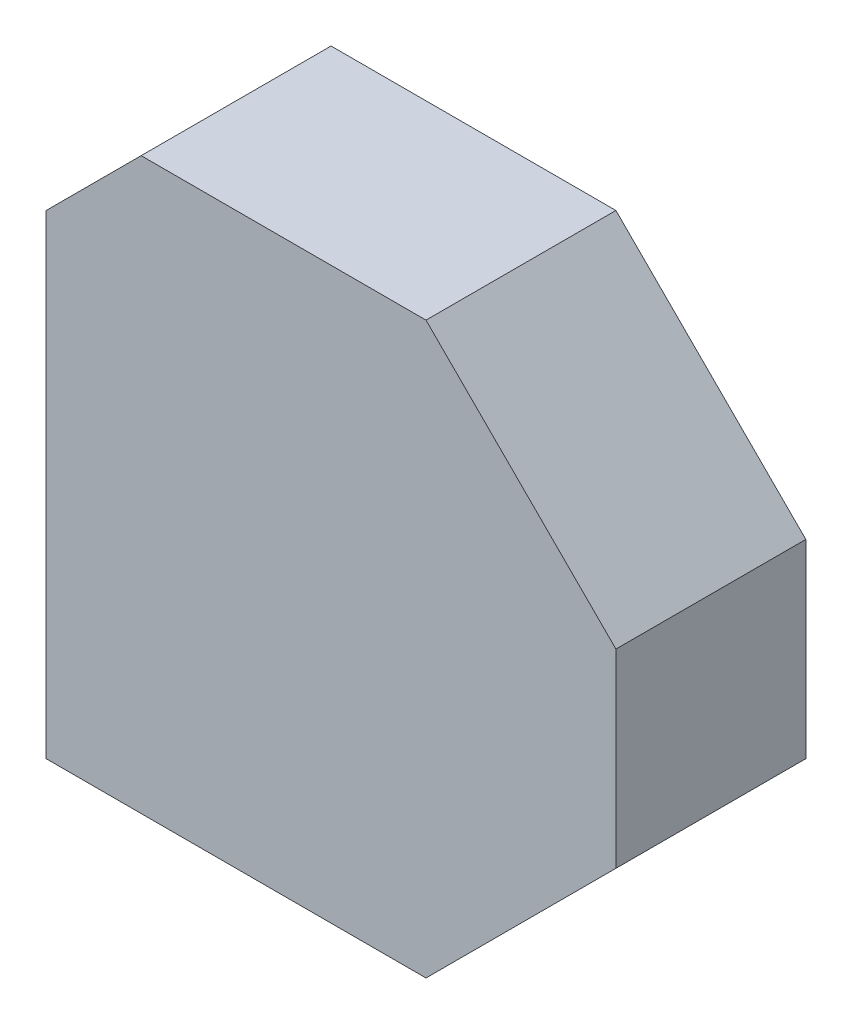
ISO-10303-21;
HEADER;
FILE_DESCRIPTION(('STEP AP214'),'2;1');
FILE_NAME('part.step','',(''),(''),'','','');
FILE_SCHEMA(('AUTOMOTIVE_DESIGN { 1 0 10303 214 1 1 1 1 }'));
ENDSEC;
DATA;
#1=APPLICATION_CONTEXT('core data for automotive mechanical design processes');
#2=APPLICATION_PROTOCOL_DEFINITION('international standard','automotive_design',2000,#1);
#3=PRODUCT_CONTEXT('',#1,'mechanical');
#4=PRODUCT('Part','Part','',(#3));
#5=PRODUCT_RELATED_PRODUCT_CATEGORY('part','',(#4));
#6=PRODUCT_DEFINITION_FORMATION('','',#4);
#7=PRODUCT_DEFINITION_CONTEXT('part definition',#1,'design');
#8=PRODUCT_DEFINITION('design','',#6,#7);
#9=PRODUCT_DEFINITION_SHAPE('','',#8);
#10=(LENGTH_UNIT() NAMED_UNIT(*) SI_UNIT(.MILLI.,.METRE.));
#11=(NAMED_UNIT(*) PLANE_ANGLE_UNIT() SI_UNIT($,.RADIAN.));
#12=(NAMED_UNIT(*) SI_UNIT($,.STERADIAN.) SOLID_ANGLE_UNIT());
#13=UNCERTAINTY_MEASURE_WITH_UNIT(LENGTH_MEASURE(1.E-05),#10,'distance_accuracy_value','');
#14=(GEOMETRIC_REPRESENTATION_CONTEXT(3) GLOBAL_UNCERTAINTY_ASSIGNED_CONTEXT((#13)) GLOBAL_UNIT_ASSIGNED_CONTEXT((#10,
#11,#12)) REPRESENTATION_CONTEXT('',''));
#15=CARTESIAN_POINT('',(0.,0.,0.));
#16=DIRECTION('',(0.,0.,1.));
#17=DIRECTION('',(1.,0.,0.));
#18=AXIS2_PLACEMENT_3D('',#15,#16,#17);
#19=CARTESIAN_POINT('',(0.,0.,10.));
#20=DIRECTION('',(1.,0.,0.));
#21=DIRECTION('',(0.,0.,-1.));
#22=AXIS2_PLACEMENT_3D('',#19,#20,#21);
#23=PLANE('',#22);
#24=DIRECTION('',(0.,-1.,0.));
#25=VECTOR('',#24,1.);
#26=CARTESIAN_POINT('',(0.,0.,10.));
#27=LINE('',#26,#25);
#28=CARTESIAN_POINT('',(0.,25.,10.));
#29=VERTEX_POINT('',#28);
#30=CARTESIAN_POINT('',(0.,0.,10.));
#31=VERTEX_POINT('',#30);
#32=EDGE_CURVE('E92',#29,#31,#27,.T.);
#33=ORIENTED_EDGE('',*,*,#32,.F.);
#34=DIRECTION('',(0.,0.,-1.));
#35=VECTOR('',#34,1.);
#36=CARTESIAN_POINT('',(0.,25.,10.));
#37=LINE('',#36,#35);
#38=CARTESIAN_POINT('',(0.,25.,0.));
#39=VERTEX_POINT('',#38);
#40=EDGE_CURVE('E138',#29,#39,#37,.T.);
#41=ORIENTED_EDGE('',*,*,#40,.T.);
#42=DIRECTION('',(0.,-1.,0.));
#43=VECTOR('',#42,1.);
#44=CARTESIAN_POINT('',(0.,0.,0.));
#45=LINE('',#44,#43);
#46=CARTESIAN_POINT('',(0.,0.,0.));
#47=VERTEX_POINT('',#46);
#48=EDGE_CURVE('E113',#39,#47,#45,.T.);
#49=ORIENTED_EDGE('',*,*,#48,.T.);
#50=DIRECTION('',(0.,0.,-1.));
#51=VECTOR('',#50,1.);
#52=CARTESIAN_POINT('',(0.,0.,10.));
#53=LINE('',#52,#51);
#54=EDGE_CURVE('E108',#31,#47,#53,.T.);
#55=ORIENTED_EDGE('',*,*,#54,.F.);
#56=EDGE_LOOP('',(#33,#41,#49,#55));
#57=FACE_BOUND('',#56,.T.);
#58=ADVANCED_FACE('F33',(#57),#23,.F.);
#59=CARTESIAN_POINT('',(0.,0.,10.));
#60=DIRECTION('',(0.,1.,0.));
#61=DIRECTION('',(0.,0.,1.));
#62=AXIS2_PLACEMENT_3D('',#59,#60,#61);
#63=PLANE('',#62);
#64=DIRECTION('',(1.,0.,0.));
#65=VECTOR('',#64,1.);
#66=CARTESIAN_POINT('',(0.,0.,0.));
#67=LINE('',#66,#65);
#68=CARTESIAN_POINT('',(20.,0.,0.));
#69=VERTEX_POINT('',#68);
#70=EDGE_CURVE('E142',#47,#69,#67,.T.);
#71=ORIENTED_EDGE('',*,*,#70,.T.);
#72=DIRECTION('',(0.,0.,1.));
#73=VECTOR('',#72,1.);
#74=CARTESIAN_POINT('',(20.,0.,10.));
#75=LINE('',#74,#73);
#76=CARTESIAN_POINT('',(20.,0.,10.));
#77=VERTEX_POINT('',#76);
#78=EDGE_CURVE('E110',#69,#77,#75,.T.);
#79=ORIENTED_EDGE('',*,*,#78,.T.);
#80=DIRECTION('',(1.,0.,0.));
#81=VECTOR('',#80,1.);
#82=CARTESIAN_POINT('',(0.,0.,10.));
#83=LINE('',#82,#81);
#84=EDGE_CURVE('E95',#31,#77,#83,.T.);
#85=ORIENTED_EDGE('',*,*,#84,.F.);
#86=ORIENTED_EDGE('',*,*,#54,.T.);
#87=EDGE_LOOP('',(#71,#79,#85,#86));
#88=FACE_BOUND('',#87,.T.);
#89=ADVANCED_FACE('F107',(#88),#63,.F.);
#90=CARTESIAN_POINT('',(30.,0.,10.));
#91=DIRECTION('',(-1.,0.,0.));
#92=DIRECTION('',(0.,0.,1.));
#93=AXIS2_PLACEMENT_3D('',#90,#91,#92);
#94=PLANE('',#93);
#95=DIRECTION('',(0.,1.,0.));
#96=VECTOR('',#95,1.);
#97=CARTESIAN_POINT('',(30.,0.,10.));
#98=LINE('',#97,#96);
#99=CARTESIAN_POINT('',(30.,10.,10.));
#100=VERTEX_POINT('',#99);
#101=CARTESIAN_POINT('',(30.,20.,10.));
#102=VERTEX_POINT('',#101);
#103=EDGE_CURVE('E111',#100,#102,#98,.T.);
#104=ORIENTED_EDGE('',*,*,#103,.F.);
#105=DIRECTION('',(0.,0.,-1.));
#106=VECTOR('',#105,1.);
#107=CARTESIAN_POINT('',(30.,10.,10.));
#108=LINE('',#107,#106);
#109=CARTESIAN_POINT('',(30.,10.,0.));
#110=VERTEX_POINT('',#109);
#111=EDGE_CURVE('E118',#100,#110,#108,.T.);
#112=ORIENTED_EDGE('',*,*,#111,.T.);
#113=DIRECTION('',(0.,1.,0.));
#114=VECTOR('',#113,1.);
#115=CARTESIAN_POINT('',(30.,0.,0.));
#116=LINE('',#115,#114);
#117=CARTESIAN_POINT('',(30.,20.,0.));
#118=VERTEX_POINT('',#117);
#119=EDGE_CURVE('E144',#110,#118,#116,.T.);
#120=ORIENTED_EDGE('',*,*,#119,.T.);
#121=DIRECTION('',(0.,0.,1.));
#122=VECTOR('',#121,1.);
#123=CARTESIAN_POINT('',(30.,20.,10.));
#124=LINE('',#123,#122);
#125=EDGE_CURVE('E115',#118,#102,#124,.T.);
#126=ORIENTED_EDGE('',*,*,#125,.T.);
#127=EDGE_LOOP('',(#104,#112,#120,#126));
#128=FACE_BOUND('',#127,.T.);
#129=ADVANCED_FACE('F165',(#128),#94,.F.);
#130=CARTESIAN_POINT('',(0.,30.,10.));
#131=DIRECTION('',(0.,-1.,0.));
#132=DIRECTION('',(0.,0.,-1.));
#133=AXIS2_PLACEMENT_3D('',#130,#131,#132);
#134=PLANE('',#133);
#135=DIRECTION('',(-1.,0.,0.));
#136=VECTOR('',#135,1.);
#137=CARTESIAN_POINT('',(0.,30.,0.));
#138=LINE('',#137,#136);
#139=CARTESIAN_POINT('',(20.,30.,0.));
#140=VERTEX_POINT('',#139);
#141=CARTESIAN_POINT('',(5.00000000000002,30.,0.));
#142=VERTEX_POINT('',#141);
#143=EDGE_CURVE('E102',#140,#142,#138,.T.);
#144=ORIENTED_EDGE('',*,*,#143,.T.);
#145=DIRECTION('',(0.,0.,1.));
#146=VECTOR('',#145,1.);
#147=CARTESIAN_POINT('',(5.00000000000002,30.,10.));
#148=LINE('',#147,#146);
#149=CARTESIAN_POINT('',(5.00000000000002,30.,10.));
#150=VERTEX_POINT('',#149);
#151=EDGE_CURVE('E41',#142,#150,#148,.T.);
#152=ORIENTED_EDGE('',*,*,#151,.T.);
#153=DIRECTION('',(-1.,0.,0.));
#154=VECTOR('',#153,1.);
#155=CARTESIAN_POINT('',(0.,30.,10.));
#156=LINE('',#155,#154);
#157=CARTESIAN_POINT('',(20.,30.,10.));
#158=VERTEX_POINT('',#157);
#159=EDGE_CURVE('E116',#158,#150,#156,.T.);
#160=ORIENTED_EDGE('',*,*,#159,.F.);
#161=DIRECTION('',(0.,0.,-1.));
#162=VECTOR('',#161,1.);
#163=CARTESIAN_POINT('',(20.,30.,10.));
#164=LINE('',#163,#162);
#165=EDGE_CURVE('E135',#158,#140,#164,.T.);
#166=ORIENTED_EDGE('',*,*,#165,.T.);
#167=EDGE_LOOP('',(#144,#152,#160,#166));
#168=FACE_BOUND('',#167,.T.);
#169=ADVANCED_FACE('F151',(#168),#134,.F.);
#170=CARTESIAN_POINT('',(0.,0.,10.));
#171=DIRECTION('',(0.,0.,-1.));
#172=DIRECTION('',(-1.,0.,0.));
#173=AXIS2_PLACEMENT_3D('',#170,#171,#172);
#174=PLANE('',#173);
#175=ORIENTED_EDGE('',*,*,#159,.T.);
#176=DIRECTION('',(0.707106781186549,0.707106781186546,0.));
#177=VECTOR('',#176,1.);
#178=CARTESIAN_POINT('',(0.,25.,10.));
#179=LINE('',#178,#177);
#180=EDGE_CURVE('E11',#150,#29,#179,.F.);
#181=ORIENTED_EDGE('',*,*,#180,.T.);
#182=ORIENTED_EDGE('',*,*,#32,.T.);
#183=ORIENTED_EDGE('',*,*,#84,.T.);
#184=DIRECTION('',(-0.707106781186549,-0.707106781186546,0.));
#185=VECTOR('',#184,1.);
#186=CARTESIAN_POINT('',(30.,10.,10.));
#187=LINE('',#186,#185);
#188=EDGE_CURVE('E133',#77,#100,#187,.F.);
#189=ORIENTED_EDGE('',*,*,#188,.T.);
#190=ORIENTED_EDGE('',*,*,#103,.T.);
#191=DIRECTION('',(0.707106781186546,-0.707106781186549,0.));
#192=VECTOR('',#191,1.);
#193=CARTESIAN_POINT('',(20.,30.,10.));
#194=LINE('',#193,#192);
#195=EDGE_CURVE('E131',#102,#158,#194,.F.);
#196=ORIENTED_EDGE('',*,*,#195,.T.);
#197=EDGE_LOOP('',(#175,#181,#182,#183,#189,#190,#196));
#198=FACE_BOUND('',#197,.T.);
#199=ADVANCED_FACE('F94',(#198),#174,.F.);
#200=CARTESIAN_POINT('',(0.,0.,0.));
#201=DIRECTION('',(0.,0.,-1.));
#202=DIRECTION('',(-1.,0.,0.));
#203=AXIS2_PLACEMENT_3D('',#200,#201,#202);
#204=PLANE('',#203);
#205=ORIENTED_EDGE('',*,*,#48,.F.);
#206=DIRECTION('',(-0.707106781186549,-0.707106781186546,0.));
#207=VECTOR('',#206,1.);
#208=CARTESIAN_POINT('',(-12.5,12.5000000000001,0.));
#209=LINE('',#208,#207);
#210=EDGE_CURVE('E55',#39,#142,#209,.F.);
#211=ORIENTED_EDGE('',*,*,#210,.T.);
#212=ORIENTED_EDGE('',*,*,#143,.F.);
#213=DIRECTION('',(-0.707106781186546,0.707106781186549,0.));
#214=VECTOR('',#213,1.);
#215=CARTESIAN_POINT('',(25.,25.,0.));
#216=LINE('',#215,#214);
#217=EDGE_CURVE('E126',#140,#118,#216,.F.);
#218=ORIENTED_EDGE('',*,*,#217,.T.);
#219=ORIENTED_EDGE('',*,*,#119,.F.);
#220=DIRECTION('',(0.707106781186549,0.707106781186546,0.));
#221=VECTOR('',#220,1.);
#222=CARTESIAN_POINT('',(9.99999999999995,-9.99999999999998,0.));
#223=LINE('',#222,#221);
#224=EDGE_CURVE('E128',#110,#69,#223,.F.);
#225=ORIENTED_EDGE('',*,*,#224,.T.);
#226=ORIENTED_EDGE('',*,*,#70,.F.);
#227=EDGE_LOOP('',(#205,#211,#212,#218,#219,#225,#226));
#228=FACE_BOUND('',#227,.T.);
#229=ADVANCED_FACE('F141',(#228),#204,.T.);
#230=CARTESIAN_POINT('',(30.,10.,10.));
#231=DIRECTION('',(-0.707106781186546,0.707106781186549,0.));
#232=DIRECTION('',(0.,0.,-1.));
#233=AXIS2_PLACEMENT_3D('',#230,#231,#232);
#234=PLANE('',#233);
#235=ORIENTED_EDGE('',*,*,#188,.F.);
#236=ORIENTED_EDGE('',*,*,#78,.F.);
#237=ORIENTED_EDGE('',*,*,#224,.F.);
#238=ORIENTED_EDGE('',*,*,#111,.F.);
#239=EDGE_LOOP('',(#235,#236,#237,#238));
#240=FACE_BOUND('',#239,.T.);
#241=ADVANCED_FACE('F158',(#240),#234,.F.);
#242=CARTESIAN_POINT('',(20.,30.,10.));
#243=DIRECTION('',(-0.707106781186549,-0.707106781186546,0.));
#244=DIRECTION('',(0.,0.,-1.));
#245=AXIS2_PLACEMENT_3D('',#242,#243,#244);
#246=PLANE('',#245);
#247=ORIENTED_EDGE('',*,*,#195,.F.);
#248=ORIENTED_EDGE('',*,*,#125,.F.);
#249=ORIENTED_EDGE('',*,*,#217,.F.);
#250=ORIENTED_EDGE('',*,*,#165,.F.);
#251=EDGE_LOOP('',(#247,#248,#249,#250));
#252=FACE_BOUND('',#251,.T.);
#253=ADVANCED_FACE('F154',(#252),#246,.F.);
#254=CARTESIAN_POINT('',(0.,25.,10.));
#255=DIRECTION('',(0.707106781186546,-0.707106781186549,0.));
#256=DIRECTION('',(0.,0.,-1.));
#257=AXIS2_PLACEMENT_3D('',#254,#255,#256);
#258=PLANE('',#257);
#259=ORIENTED_EDGE('',*,*,#180,.F.);
#260=ORIENTED_EDGE('',*,*,#151,.F.);
#261=ORIENTED_EDGE('',*,*,#210,.F.);
#262=ORIENTED_EDGE('',*,*,#40,.F.);
#263=EDGE_LOOP('',(#259,#260,#261,#262));
#264=FACE_BOUND('',#263,.T.);
#265=ADVANCED_FACE('F35',(#264),#258,.F.);
#266=CLOSED_SHELL('',(#58,#89,#129,#169,#199,#229,#241,#253,#265));
#267=MANIFOLD_SOLID_BREP('B2',#266);
#268=ADVANCED_BREP_SHAPE_REPRESENTATION('',(#18,#267),#14);
#269=SHAPE_DEFINITION_REPRESENTATION(#9,#268);
ENDSEC;
END-ISO-10303-21;
